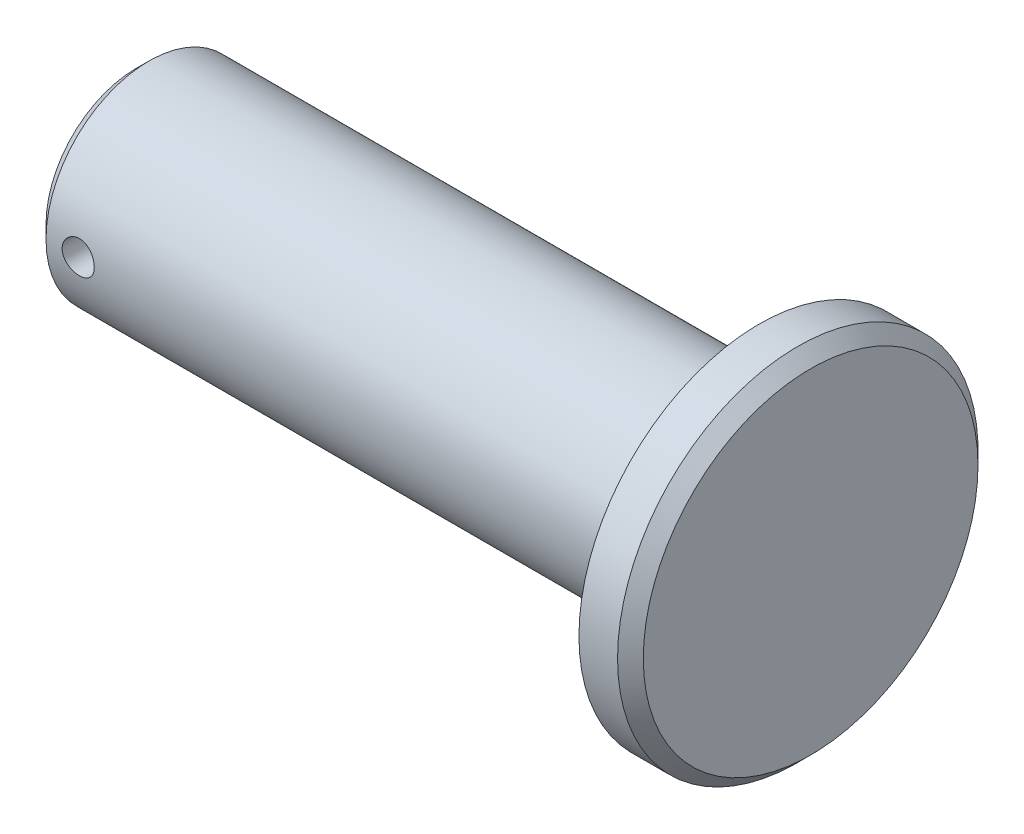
from build123d import *

# Parameters (mm, degrees)
ENL_V_MAT_EXTRU_1_DEPTH      = 10
ENL_V_MAT_EXTRU_1_DEPTH_BACK = 10
ESQUISSE2_R                  = 1.25


with BuildPart() as part:
    # Esquisse1 → R_volution3 (revolve)
    with BuildSketch(Plane.XY, mode=Mode.PRIVATE) as r_volution3_sk:
        Polygon((-52.4, 0), (-52.4, 7), (-51.4, 8), (-4, 8), (-4, 14), (-1, 14), (0, 13), (0, 0), align=None)
    revolve(r_volution3_sk.sketch.rotate(Axis((-61.888787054, 0, 0), (1, 0, 0)), 90), axis=Axis((-61.888787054, 0, 0), (1, 0, 0)))

    # Esquisse2 → Enl_v. mat.-Extru.1 (cut, two sides: drawn at the far end of the back side and taken through both)
    with BuildSketch(Plane.XY.offset(-ENL_V_MAT_EXTRU_1_DEPTH_BACK)):
        with Locations((-48.9, 0)):
            Circle(ESQUISSE2_R)
    extrude(amount=ENL_V_MAT_EXTRU_1_DEPTH + ENL_V_MAT_EXTRU_1_DEPTH_BACK, mode=Mode.SUBTRACT)


solid = part.part
